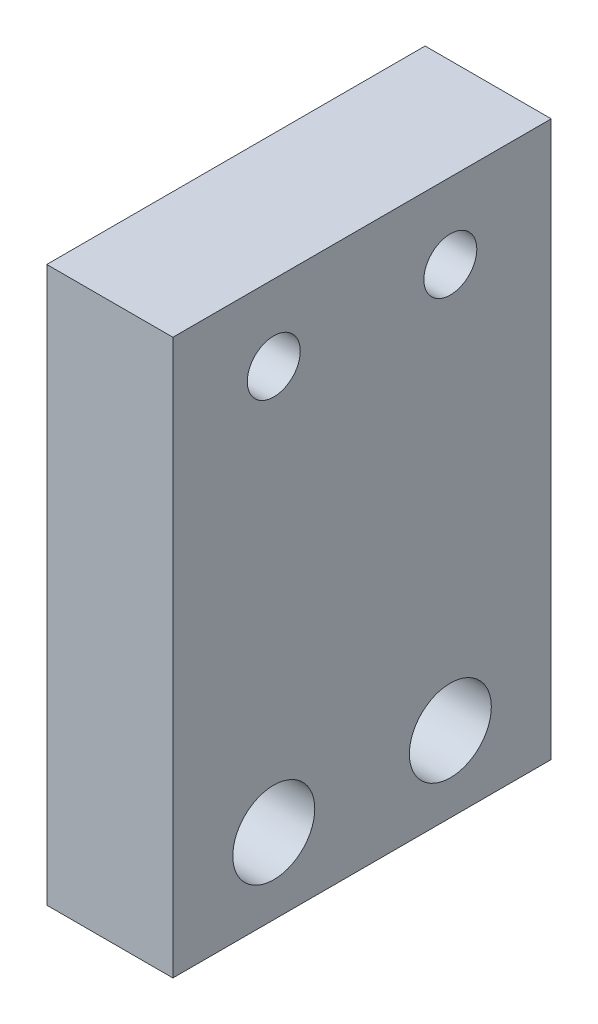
from build123d import *

# Parameters (mm, degrees)
SKETCH_1_W          = 10
SKETCH_1_H          = 44
EXTRUDE_1_DEPTH     = 30
SKETCH_2_R          = 3.25
SKETCH_2_R_2        = 2.1
CUT_EXTRUDE_1_DEPTH = 30
SKETCH_4_R          = 5.5
CUT_EXTRUDE_2_DEPTH = 4.5


with BuildPart() as part:
    # Sketch 1 → Extrude 1 (new body)
    with BuildSketch(Plane.XY):
        with Locations((5, 22)):
            Rectangle(SKETCH_1_W, SKETCH_1_H)
    extrude(amount=EXTRUDE_1_DEPTH)

    # Sketch 2 → Cut-Extrude 1 (cut)
    with BuildSketch(Plane(origin=(10, 0, 0), x_dir=(0, 0, -1), z_dir=(1, 0, 0))):
        with Locations((-22, 6)):
            Circle(SKETCH_2_R)
        with Locations((-8, 6)):
            Circle(SKETCH_2_R)
        with Locations((-22, 38)):
            Circle(SKETCH_2_R_2)
        with Locations((-8, 38)):
            Circle(SKETCH_2_R_2)
    extrude(amount=-CUT_EXTRUDE_1_DEPTH, mode=Mode.SUBTRACT)

    # Sketch 4 → Cut-Extrude 2 (cut)
    with BuildSketch(Plane.ZY):
        with Locations((8, 6)):
            Circle(SKETCH_4_R)
        with Locations((22, 6)):
            Circle(SKETCH_4_R)
    extrude(amount=-CUT_EXTRUDE_2_DEPTH, mode=Mode.SUBTRACT)


solid = part.part
